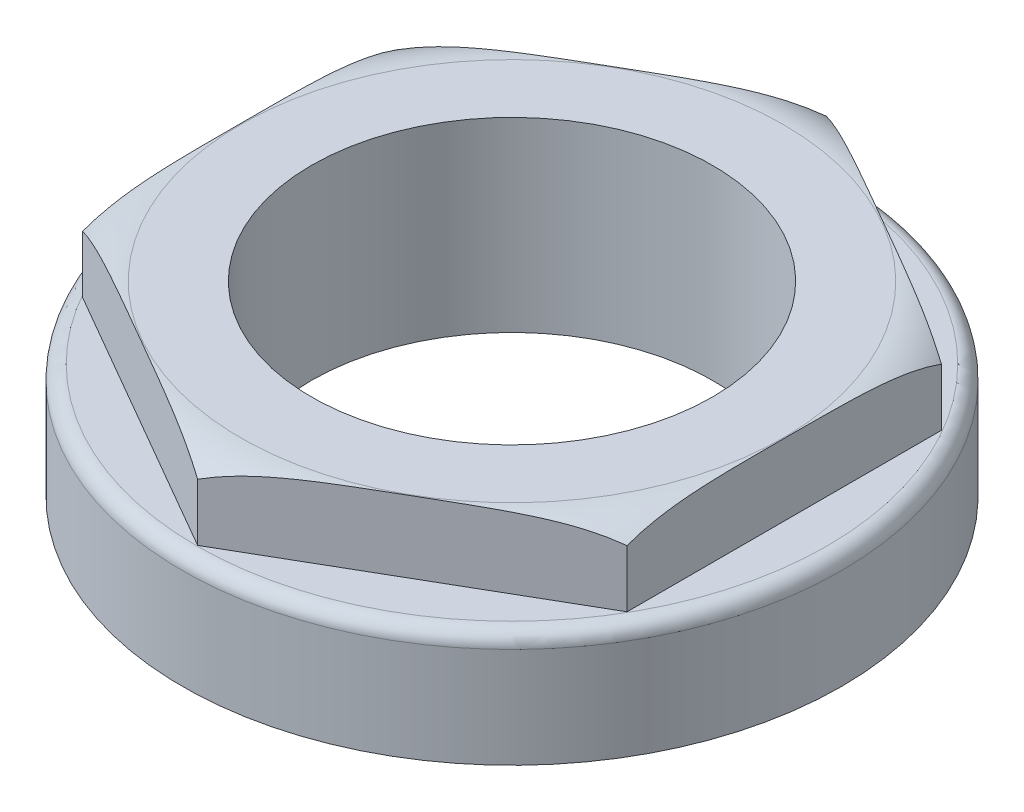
ISO-10303-21;
HEADER;
FILE_DESCRIPTION(('STEP AP214'),'2;1');
FILE_NAME('part.step','',(''),(''),'','','');
FILE_SCHEMA(('AUTOMOTIVE_DESIGN { 1 0 10303 214 1 1 1 1 }'));
ENDSEC;
DATA;
#1=APPLICATION_CONTEXT('core data for automotive mechanical design processes');
#2=APPLICATION_PROTOCOL_DEFINITION('international standard','automotive_design',2000,#1);
#3=PRODUCT_CONTEXT('',#1,'mechanical');
#4=PRODUCT('Part','Part','',(#3));
#5=PRODUCT_RELATED_PRODUCT_CATEGORY('part','',(#4));
#6=PRODUCT_DEFINITION_FORMATION('','',#4);
#7=PRODUCT_DEFINITION_CONTEXT('part definition',#1,'design');
#8=PRODUCT_DEFINITION('design','',#6,#7);
#9=PRODUCT_DEFINITION_SHAPE('','',#8);
#10=(LENGTH_UNIT() NAMED_UNIT(*) SI_UNIT(.MILLI.,.METRE.));
#11=(NAMED_UNIT(*) PLANE_ANGLE_UNIT() SI_UNIT($,.RADIAN.));
#12=(NAMED_UNIT(*) SI_UNIT($,.STERADIAN.) SOLID_ANGLE_UNIT());
#13=UNCERTAINTY_MEASURE_WITH_UNIT(LENGTH_MEASURE(1.E-05),#10,'distance_accuracy_value','');
#14=(GEOMETRIC_REPRESENTATION_CONTEXT(3) GLOBAL_UNCERTAINTY_ASSIGNED_CONTEXT((#13)) GLOBAL_UNIT_ASSIGNED_CONTEXT((#10,
#11,#12)) REPRESENTATION_CONTEXT('',''));
#15=CARTESIAN_POINT('',(0.,0.,0.));
#16=DIRECTION('',(0.,0.,1.));
#17=DIRECTION('',(1.,0.,0.));
#18=AXIS2_PLACEMENT_3D('',#15,#16,#17);
#19=CARTESIAN_POINT('',(19.,-58.045958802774,-10.9696551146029));
#20=DIRECTION('',(0.5,0.,-0.866025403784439));
#21=DIRECTION('',(-0.866025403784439,0.,-0.5));
#22=AXIS2_PLACEMENT_3D('',#19,#20,#21);
#23=PLANE('',#22);
#24=DIRECTION('',(0.,1.,0.));
#25=VECTOR('',#24,1.);
#26=CARTESIAN_POINT('',(0.,-58.045958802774,-21.9393102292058));
#27=LINE('',#26,#25);
#28=CARTESIAN_POINT('',(0.,2.,-21.9393102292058));
#29=VERTEX_POINT('',#28);
#30=CARTESIAN_POINT('',(0.,6.,-21.9393102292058));
#31=VERTEX_POINT('',#30);
#32=EDGE_CURVE('E99',#29,#31,#27,.T.);
#33=ORIENTED_EDGE('',*,*,#32,.T.);
#34=CARTESIAN_POINT('',(-0.000200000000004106,5.99991339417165,-21.9394256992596));
#35=CARTESIAN_POINT('',(0.148237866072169,6.06416734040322,-21.8537250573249));
#36=CARTESIAN_POINT('',(0.298156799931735,6.12368368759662,-21.7671693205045));
#37=CARTESIAN_POINT('',(0.600251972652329,6.23413918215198,-21.5927545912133));
#38=CARTESIAN_POINT('',(0.752426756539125,6.28508361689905,-21.5048964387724));
#39=CARTESIAN_POINT('',(1.05804415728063,6.37922577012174,-21.3284481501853));
#40=CARTESIAN_POINT('',(1.2114814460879,6.42244679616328,-21.2398610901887));
#41=CARTESIAN_POINT('',(1.51967527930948,6.50216553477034,-21.0619252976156));
#42=CARTESIAN_POINT('',(1.6744320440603,6.53866210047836,-20.9725764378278));
#43=CARTESIAN_POINT('',(2.14074382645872,6.63936169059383,-20.7033512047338));
#44=CARTESIAN_POINT('',(2.45376390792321,6.69460380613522,-20.5226289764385));
#45=CARTESIAN_POINT('',(2.92482405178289,6.76365566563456,-20.2506622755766));
#46=CARTESIAN_POINT('',(3.0821683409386,6.78437711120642,-20.1598195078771));
#47=CARTESIAN_POINT('',(3.39721719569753,6.82179787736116,-19.9779259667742));
#48=CARTESIAN_POINT('',(3.55492175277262,6.83849729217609,-19.8868751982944));
#49=CARTESIAN_POINT('',(3.95811915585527,6.87674254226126,-19.6540890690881));
#50=CARTESIAN_POINT('',(4.20378424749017,6.89583849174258,-19.5122542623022));
#51=CARTESIAN_POINT('',(4.69543372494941,6.92756527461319,-19.2284003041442));
#52=CARTESIAN_POINT('',(4.9414181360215,6.94019556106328,-19.0863811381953));
#53=CARTESIAN_POINT('',(5.43361965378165,6.96064049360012,-18.8022084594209));
#54=CARTESIAN_POINT('',(5.67983681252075,6.96845339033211,-18.6600549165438));
#55=CARTESIAN_POINT('',(6.17232306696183,6.98067503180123,-18.37571784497));
#56=CARTESIAN_POINT('',(6.41859216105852,6.98508386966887,-18.2335343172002));
#57=CARTESIAN_POINT('',(6.91141536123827,6.99168275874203,-17.9490027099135));
#58=CARTESIAN_POINT('',(7.15796948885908,6.99387041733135,-17.8066546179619));
#59=CARTESIAN_POINT('',(7.65108384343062,6.99695413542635,-17.5219549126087));
#60=CARTESIAN_POINT('',(7.89764407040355,6.99785018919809,-17.3796032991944));
#61=CARTESIAN_POINT('',(8.39070366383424,6.9990202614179,-17.0949352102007));
#62=CARTESIAN_POINT('',(8.63720303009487,6.99929443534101,-16.9526187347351));
#63=CARTESIAN_POINT('',(9.13020105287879,6.99960994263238,-16.6679861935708));
#64=CARTESIAN_POINT('',(9.37669970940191,6.9996512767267,-16.5256701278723));
#65=CARTESIAN_POINT('',(9.86954144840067,6.99959907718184,-16.2411278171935));
#66=CARTESIAN_POINT('',(10.1158845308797,6.99950562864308,-16.0989015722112));
#67=CARTESIAN_POINT('',(10.6085714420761,6.99898888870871,-15.8144486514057));
#68=CARTESIAN_POINT('',(10.854915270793,6.99856559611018,-15.6722219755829));
#69=CARTESIAN_POINT('',(11.3476691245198,6.99690649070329,-15.3877304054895));
#70=CARTESIAN_POINT('',(11.594079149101,6.9956704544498,-15.2454655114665));
#71=CARTESIAN_POINT('',(12.0868896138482,6.99162741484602,-14.9609412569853));
#72=CARTESIAN_POINT('',(12.3332900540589,6.98882042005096,-14.8186818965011));
#73=CARTESIAN_POINT('',(12.8257539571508,6.98062254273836,-14.5343577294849));
#74=CARTESIAN_POINT('',(13.0718174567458,6.97523488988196,-14.392292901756));
#75=CARTESIAN_POINT('',(13.5638723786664,6.96061892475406,-14.108204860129));
#76=CARTESIAN_POINT('',(13.8098637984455,6.95139049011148,-13.9661816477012));
#77=CARTESIAN_POINT('',(14.3015568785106,6.92760586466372,-13.682302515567));
#78=CARTESIAN_POINT('',(14.5472586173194,6.91305192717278,-13.5404465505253));
#79=CARTESIAN_POINT('',(15.0382654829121,6.87689657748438,-13.2569636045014));
#80=CARTESIAN_POINT('',(15.2835706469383,6.85529587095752,-13.1153366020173));
#81=CARTESIAN_POINT('',(15.6760887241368,6.81345804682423,-12.8887161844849));
#82=CARTESIAN_POINT('',(15.8235296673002,6.7960925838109,-12.80359111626));
#83=CARTESIAN_POINT('',(16.118043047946,6.75760805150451,-12.6335537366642));
#84=CARTESIAN_POINT('',(16.2651154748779,6.73648887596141,-12.5486414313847));
#85=CARTESIAN_POINT('',(16.705416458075,6.66677447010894,-12.2944335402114));
#86=CARTESIAN_POINT('',(16.9979433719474,6.61180096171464,-12.125543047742));
#87=CARTESIAN_POINT('',(17.4338057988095,6.51319175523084,-11.8738977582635));
#88=CARTESIAN_POINT('',(17.5785294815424,6.47765359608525,-11.7903415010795));
#89=CARTESIAN_POINT('',(17.8667542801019,6.40053963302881,-11.6239348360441));
#90=CARTESIAN_POINT('',(18.0102555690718,6.35896469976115,-11.5410843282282));
#91=CARTESIAN_POINT('',(18.296062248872,6.26896644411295,-11.3760737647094));
#92=CARTESIAN_POINT('',(18.438363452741,6.22052523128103,-11.2939161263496));
#93=CARTESIAN_POINT('',(18.7209453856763,6.11608171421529,-11.1307673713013));
#94=CARTESIAN_POINT('',(18.861225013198,6.06007544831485,-11.0497768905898));
#95=CARTESIAN_POINT('',(19.0002,5.99991339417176,-10.9695396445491));
#96=B_SPLINE_CURVE_WITH_KNOTS('',3,(#34,#35,#36,#37,#38,#39,#40,#41,#42,#43,#44,#45,#46,#47,#48,
#49,#50,#51,#52,#53,#54,#55,#56,#57,#58,#59,#60,#61,#62,#63,#64,#65,#66,#67,#68,#69,#70,#71,#72,
#73,#74,#75,#76,#77,#78,#79,#80,#81,#82,#83,#84,#85,#86,#87,#88,#89,#90,#91,#92,#93,#94,#95),
.UNSPECIFIED.,.F.,.F.,(4,2,2,2,2,2,2,2,2,2,2,2,2,2,2,2,2,2,2,2,2,2,2,2,2,2,2,2,2,2,4),(0.,
0.548988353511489,1.09763682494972,1.6446005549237,2.19165748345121,3.28782837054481,
3.83639446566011,4.3849477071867,5.23778011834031,6.09068465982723,6.94389873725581,
7.79708947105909,8.65119827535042,9.50531087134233,10.3592099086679,11.2131062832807,
12.0664637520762,12.9198243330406,13.7734196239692,14.6270102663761,15.479535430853,
16.3320877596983,17.1842797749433,18.0363864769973,18.5497465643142,19.063121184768,
20.089124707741,20.6015844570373,21.1139703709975,21.6277167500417,22.1417332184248),.UNSPECIFIED.);
#97=CARTESIAN_POINT('',(19.,5.99999999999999,-10.9696551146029));
#98=VERTEX_POINT('',#97);
#99=EDGE_CURVE('E47',#31,#98,#96,.T.);
#100=ORIENTED_EDGE('',*,*,#99,.T.);
#101=DIRECTION('',(0.,1.,0.));
#102=VECTOR('',#101,1.);
#103=CARTESIAN_POINT('',(19.,-58.045958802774,-10.9696551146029));
#104=LINE('',#103,#102);
#105=CARTESIAN_POINT('',(19.,2.,-10.9696551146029));
#106=VERTEX_POINT('',#105);
#107=EDGE_CURVE('E97',#106,#98,#104,.T.);
#108=ORIENTED_EDGE('',*,*,#107,.F.);
#109=DIRECTION('',(-0.866025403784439,0.,-0.5));
#110=VECTOR('',#109,1.);
#111=CARTESIAN_POINT('',(26.75,2.,-6.4951905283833));
#112=LINE('',#111,#110);
#113=EDGE_CURVE('E130',#106,#29,#112,.T.);
#114=ORIENTED_EDGE('',*,*,#113,.T.);
#115=EDGE_LOOP('',(#33,#100,#108,#114));
#116=FACE_BOUND('',#115,.T.);
#117=ADVANCED_FACE('F32',(#116),#23,.T.);
#118=CARTESIAN_POINT('',(19.,-58.045958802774,10.9696551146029));
#119=DIRECTION('',(1.,0.,0.));
#120=DIRECTION('',(0.,0.,-1.));
#121=AXIS2_PLACEMENT_3D('',#118,#119,#120);
#122=PLANE('',#121);
#123=ORIENTED_EDGE('',*,*,#107,.T.);
#124=CARTESIAN_POINT('',(19.,6.99963166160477,0.));
#125=CARTESIAN_POINT('',(19.,6.99963666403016,0.421055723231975));
#126=CARTESIAN_POINT('',(19.,6.99952182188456,0.842111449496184));
#127=CARTESIAN_POINT('',(19.,6.99837124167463,1.68423710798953));
#128=CARTESIAN_POINT('',(19.,6.99733547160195,2.10530704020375));
#129=CARTESIAN_POINT('',(19.,6.99226415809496,2.94840806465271));
#130=CARTESIAN_POINT('',(19.,6.98822169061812,3.37043913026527));
#131=CARTESIAN_POINT('',(19.,6.97377809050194,4.2143811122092));
#132=CARTESIAN_POINT('',(19.,6.96337740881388,4.63629203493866));
#133=CARTESIAN_POINT('',(19.,6.93188628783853,5.47464152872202));
#134=CARTESIAN_POINT('',(19.,6.91092691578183,5.89108445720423));
#135=CARTESIAN_POINT('',(19.,6.8529359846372,6.72306356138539));
#136=CARTESIAN_POINT('',(19.,6.81589854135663,7.13859934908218));
#137=CARTESIAN_POINT('',(19.,6.71935255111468,7.96556310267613));
#138=CARTESIAN_POINT('',(19.,6.65993465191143,8.37700085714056));
#139=CARTESIAN_POINT('',(19.,6.5480881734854,8.98984084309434));
#140=CARTESIAN_POINT('',(19.,6.50703933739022,9.19332481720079));
#141=CARTESIAN_POINT('',(19.,6.41622666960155,9.59832433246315));
#142=CARTESIAN_POINT('',(19.,6.36646456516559,9.7998402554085));
#143=CARTESIAN_POINT('',(19.,6.26573350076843,10.1681930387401));
#144=CARTESIAN_POINT('',(19.,6.21622651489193,10.335428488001));
#145=CARTESIAN_POINT('',(19.,6.10936568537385,10.6674539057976));
#146=CARTESIAN_POINT('',(19.,6.05200917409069,10.8322430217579));
#147=CARTESIAN_POINT('',(19.,5.92843184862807,11.1590020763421));
#148=CARTESIAN_POINT('',(19.,5.86218725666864,11.3209630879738));
#149=CARTESIAN_POINT('',(19.,5.72004563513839,11.6405924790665));
#150=CARTESIAN_POINT('',(19.,5.6441495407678,11.7982612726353));
#151=CARTESIAN_POINT('',(19.,5.48067371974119,12.1100598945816));
#152=CARTESIAN_POINT('',(19.,5.3929579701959,12.2641194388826));
#153=CARTESIAN_POINT('',(19.,5.20568772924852,12.564814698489));
#154=CARTESIAN_POINT('',(19.,5.1061303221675,12.7114485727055));
#155=CARTESIAN_POINT('',(19.,4.78871785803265,13.1362340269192));
#156=CARTESIAN_POINT('',(19.,4.55133442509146,13.4008519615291));
#157=CARTESIAN_POINT('',(19.,4.13397392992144,13.7690332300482));
#158=CARTESIAN_POINT('',(19.,3.97218356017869,13.8933771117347));
#159=CARTESIAN_POINT('',(19.,3.63091651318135,14.1154753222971));
#160=CARTESIAN_POINT('',(19.,3.45144983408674,14.2132445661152));
#161=CARTESIAN_POINT('',(19.,3.17064575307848,14.3354068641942));
#162=CARTESIAN_POINT('',(19.,3.07457095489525,14.372173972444));
#163=CARTESIAN_POINT('',(19.,2.8794113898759,14.4365273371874));
#164=CARTESIAN_POINT('',(19.,2.78032823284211,14.4641184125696));
#165=CARTESIAN_POINT('',(19.,2.57998473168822,14.5094878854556));
#166=CARTESIAN_POINT('',(19.,2.47872541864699,14.5272708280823));
#167=CARTESIAN_POINT('',(19.,2.2749384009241,14.5526136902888));
#168=CARTESIAN_POINT('',(19.,2.17241087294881,14.5601750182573));
#169=CARTESIAN_POINT('',(19.,1.9801465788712,14.5645854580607));
#170=CARTESIAN_POINT('',(19.,1.89043684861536,14.5626716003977));
#171=CARTESIAN_POINT('',(19.,1.7115256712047,14.5509592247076));
#172=CARTESIAN_POINT('',(19.,1.62232439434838,14.5411582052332));
#173=CARTESIAN_POINT('',(19.,1.3565860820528,14.5001494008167));
#174=CARTESIAN_POINT('',(19.,1.18171608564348,14.4573398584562));
#175=CARTESIAN_POINT('',(19.,0.846120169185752,14.345337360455));
#176=CARTESIAN_POINT('',(19.,0.685140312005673,14.2768850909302));
#177=CARTESIAN_POINT('',(19.,0.374845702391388,14.117439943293));
#178=CARTESIAN_POINT('',(19.,0.225534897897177,14.0264394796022));
#179=CARTESIAN_POINT('',(19.,-0.130769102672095,13.7761937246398));
#180=CARTESIAN_POINT('',(19.,-0.329699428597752,13.6054720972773));
#181=CARTESIAN_POINT('',(19.,-0.697871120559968,13.2344244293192));
#182=CARTESIAN_POINT('',(19.,-0.867034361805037,13.0340229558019));
#183=CARTESIAN_POINT('',(19.,-1.14215878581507,12.6608666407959));
#184=CARTESIAN_POINT('',(19.,-1.25374811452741,12.4921713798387));
#185=CARTESIAN_POINT('',(19.,-1.46177905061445,12.1456043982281));
#186=CARTESIAN_POINT('',(19.,-1.55821163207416,11.9677272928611));
#187=CARTESIAN_POINT('',(19.,-1.73739481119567,11.6051384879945));
#188=CARTESIAN_POINT('',(19.,-1.82013666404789,11.4204225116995));
#189=CARTESIAN_POINT('',(19.,-1.97332042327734,11.0460497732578));
#190=CARTESIAN_POINT('',(19.,-2.0437648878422,10.8563940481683));
#191=CARTESIAN_POINT('',(19.,-2.18889619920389,10.4288209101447));
#192=CARTESIAN_POINT('',(19.,-2.26075243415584,10.189947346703));
#193=CARTESIAN_POINT('',(19.,-2.39028818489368,9.70834320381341));
#194=CARTESIAN_POINT('',(19.,-2.44796176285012,9.46561105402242));
#195=CARTESIAN_POINT('',(19.,-2.55129296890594,8.97721976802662));
#196=CARTESIAN_POINT('',(19.,-2.59693075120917,8.73155648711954));
#197=CARTESIAN_POINT('',(19.,-2.67795309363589,8.23860427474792));
#198=CARTESIAN_POINT('',(19.,-2.71333895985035,7.99131555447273));
#199=CARTESIAN_POINT('',(19.,-2.7757514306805,7.49412378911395));
#200=CARTESIAN_POINT('',(19.,-2.80272404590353,7.24421408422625));
#201=CARTESIAN_POINT('',(19.,-2.84954675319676,6.74373528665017));
#202=CARTESIAN_POINT('',(19.,-2.86939663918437,6.49316617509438));
#203=CARTESIAN_POINT('',(19.,-2.90333700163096,5.99186490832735));
#204=CARTESIAN_POINT('',(19.,-2.91743242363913,5.74113307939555));
#205=CARTESIAN_POINT('',(19.,-2.94110636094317,5.23946770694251));
#206=CARTESIAN_POINT('',(19.,-2.95068495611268,4.98853416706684));
#207=CARTESIAN_POINT('',(19.,-2.9728611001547,4.28150872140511));
#208=CARTESIAN_POINT('',(19.,-2.98153145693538,3.82529894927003));
#209=CARTESIAN_POINT('',(19.,-2.99293535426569,2.91280305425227));
#210=CARTESIAN_POINT('',(19.,-2.99566849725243,2.45651692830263));
#211=CARTESIAN_POINT('',(19.,-2.99884044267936,1.54368809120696));
#212=CARTESIAN_POINT('',(19.,-2.99927798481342,1.08714537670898));
#213=CARTESIAN_POINT('',(19.,-2.99970944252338,0.174082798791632));
#214=CARTESIAN_POINT('',(19.,-2.99970337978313,-0.282437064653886));
#215=CARTESIAN_POINT('',(19.,-2.99916945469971,-1.19628692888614));
#216=CARTESIAN_POINT('',(19.,-2.99864066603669,-1.65361692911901));
#217=CARTESIAN_POINT('',(19.,-2.9950491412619,-2.56831430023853));
#218=CARTESIAN_POINT('',(19.,-2.99198618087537,-3.02568167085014));
#219=CARTESIAN_POINT('',(19.,-2.97950719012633,-3.93998719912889));
#220=CARTESIAN_POINT('',(19.,-2.97009612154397,-4.39692541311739));
#221=CARTESIAN_POINT('',(19.,-2.93948948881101,-5.31040151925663));
#222=CARTESIAN_POINT('',(19.,-2.91829605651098,-5.76693946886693));
#223=CARTESIAN_POINT('',(19.,-2.87208178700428,-6.45540507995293));
#224=CARTESIAN_POINT('',(19.,-2.85402311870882,-6.68779334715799));
#225=CARTESIAN_POINT('',(19.,-2.81189819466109,-7.15201818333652));
#226=CARTESIAN_POINT('',(19.,-2.78783238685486,-7.38385479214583));
#227=CARTESIAN_POINT('',(19.,-2.7324537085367,-7.84697050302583));
#228=CARTESIAN_POINT('',(19.,-2.70113174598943,-8.07824853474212));
#229=CARTESIAN_POINT('',(19.,-2.62991033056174,-8.53948870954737));
#230=CARTESIAN_POINT('',(19.,-2.59001125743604,-8.76945091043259));
#231=CARTESIAN_POINT('',(19.,-2.50061657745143,-9.22498920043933));
#232=CARTESIAN_POINT('',(19.,-2.45122743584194,-9.45058593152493));
#233=CARTESIAN_POINT('',(19.,-2.34096562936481,-9.89903434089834));
#234=CARTESIAN_POINT('',(19.,-2.28009087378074,-10.1218855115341));
#235=CARTESIAN_POINT('',(19.,-2.14523374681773,-10.5630562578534));
#236=CARTESIAN_POINT('',(19.,-2.07128232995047,-10.7813852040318));
#237=CARTESIAN_POINT('',(19.,-1.9082510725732,-11.2122591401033));
#238=CARTESIAN_POINT('',(19.,-1.81918047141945,-11.4248075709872));
#239=CARTESIAN_POINT('',(19.,-1.65266590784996,-11.7801893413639));
#240=CARTESIAN_POINT('',(19.,-1.57956748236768,-11.9250588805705));
#241=CARTESIAN_POINT('',(19.,-1.42401233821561,-12.2097440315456));
#242=CARTESIAN_POINT('',(19.,-1.34155441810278,-12.3495589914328));
#243=CARTESIAN_POINT('',(19.,-1.16652741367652,-12.622739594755));
#244=CARTESIAN_POINT('',(19.,-1.07395942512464,-12.756105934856));
#245=CARTESIAN_POINT('',(19.,-0.878060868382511,-13.0146220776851));
#246=CARTESIAN_POINT('',(19.,-0.774734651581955,-13.1397751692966));
#247=CARTESIAN_POINT('',(19.,-0.512969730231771,-13.4280065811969));
#248=CARTESIAN_POINT('',(19.,-0.349031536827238,-13.5862004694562));
#249=CARTESIAN_POINT('',(19.,0.00152040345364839,-13.8750697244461));
#250=CARTESIAN_POINT('',(19.,0.188099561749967,-14.0057862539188));
#251=CARTESIAN_POINT('',(19.,0.546726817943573,-14.2109912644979));
#252=CARTESIAN_POINT('',(19.,0.715387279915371,-14.2913581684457));
#253=CARTESIAN_POINT('',(19.,1.06378627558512,-14.4229590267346));
#254=CARTESIAN_POINT('',(19.,1.2435180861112,-14.4742104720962));
#255=CARTESIAN_POINT('',(19.,1.61025243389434,-14.5439795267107));
#256=CARTESIAN_POINT('',(19.,1.79728663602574,-14.5623333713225));
#257=CARTESIAN_POINT('',(19.,2.17152560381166,-14.5642462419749));
#258=CARTESIAN_POINT('',(19.,2.35873034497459,-14.5478096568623));
#259=CARTESIAN_POINT('',(19.,2.71222491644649,-14.4842307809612));
#260=CARTESIAN_POINT('',(19.,2.87898838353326,-14.4396554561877));
#261=CARTESIAN_POINT('',(19.,3.20350595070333,-14.325189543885));
#262=CARTESIAN_POINT('',(19.,3.36125725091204,-14.2552911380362));
#263=CARTESIAN_POINT('',(19.,3.71696616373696,-14.0663803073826));
#264=CARTESIAN_POINT('',(19.,3.91034501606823,-13.9387490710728));
#265=CARTESIAN_POINT('',(19.,4.2738120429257,-13.6538609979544));
#266=CARTESIAN_POINT('',(19.,4.44385476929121,-13.4965477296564));
#267=CARTESIAN_POINT('',(19.,4.83241111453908,-13.0841416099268));
#268=CARTESIAN_POINT('',(19.,5.03810907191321,-12.8169854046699));
#269=CARTESIAN_POINT('',(19.,5.31365821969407,-12.3954464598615));
#270=CARTESIAN_POINT('',(19.,5.40010092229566,-12.251261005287));
#271=CARTESIAN_POINT('',(19.,5.56290738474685,-11.9572921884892));
#272=CARTESIAN_POINT('',(19.,5.6392728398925,-11.8075097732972));
#273=CARTESIAN_POINT('',(19.,5.83695210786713,-11.3888618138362));
#274=CARTESIAN_POINT('',(19.,5.94867092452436,-11.1154694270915));
#275=CARTESIAN_POINT('',(19.,6.1481458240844,-10.5600338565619));
#276=CARTESIAN_POINT('',(19.,6.23588122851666,-10.2779834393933));
#277=CARTESIAN_POINT('',(19.,6.39139261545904,-9.7080406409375));
#278=CARTESIAN_POINT('',(19.,6.45913697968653,-9.42013976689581));
#279=CARTESIAN_POINT('',(19.,6.57795176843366,-8.84112079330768));
#280=CARTESIAN_POINT('',(19.,6.62902929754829,-8.55000411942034));
#281=CARTESIAN_POINT('',(19.,6.72480744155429,-7.91833258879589));
#282=CARTESIAN_POINT('',(19.,6.76712709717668,-7.57742335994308));
#283=CARTESIAN_POINT('',(19.,6.83760816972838,-6.8941141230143));
#284=CARTESIAN_POINT('',(19.,6.86576573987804,-6.55171373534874));
#285=CARTESIAN_POINT('',(19.,6.91150416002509,-5.86580428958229));
#286=CARTESIAN_POINT('',(19.,6.92907159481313,-5.52229437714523));
#287=CARTESIAN_POINT('',(19.,6.95663298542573,-4.83502320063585));
#288=CARTESIAN_POINT('',(19.,6.96662762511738,-4.49126196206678));
#289=CARTESIAN_POINT('',(19.,6.98164964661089,-3.80170262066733));
#290=CARTESIAN_POINT('',(19.,6.98664870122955,-3.45590396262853));
#291=CARTESIAN_POINT('',(19.,6.99366910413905,-2.76427582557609));
#292=CARTESIAN_POINT('',(19.,6.99569040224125,-2.41844634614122));
#293=CARTESIAN_POINT('',(19.,6.9982927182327,-1.7271780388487));
#294=CARTESIAN_POINT('',(19.,6.99887537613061,-1.38173921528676));
#295=CARTESIAN_POINT('',(19.,6.99954279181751,-0.690866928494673));
#296=CARTESIAN_POINT('',(19.,6.99962755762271,-0.345433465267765));
#297=CARTESIAN_POINT('',(19.,6.99963166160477,0.));
#298=B_SPLINE_CURVE_WITH_KNOTS('',3,(#124,#125,#126,#127,#128,#129,#130,#131,#132,#133,#134,
#135,#136,#137,#138,#139,#140,#141,#142,#143,#144,#145,#146,#147,#148,#149,#150,#151,#152,#153,
#154,#155,#156,#157,#158,#159,#160,#161,#162,#163,#164,#165,#166,#167,#168,#169,#170,#171,#172,
#173,#174,#175,#176,#177,#178,#179,#180,#181,#182,#183,#184,#185,#186,#187,#188,#189,#190,#191,
#192,#193,#194,#195,#196,#197,#198,#199,#200,#201,#202,#203,#204,#205,#206,#207,#208,#209,#210,
#211,#212,#213,#214,#215,#216,#217,#218,#219,#220,#221,#222,#223,#224,#225,#226,#227,#228,#229,
#230,#231,#232,#233,#234,#235,#236,#237,#238,#239,#240,#241,#242,#243,#244,#245,#246,#247,#248,
#249,#250,#251,#252,#253,#254,#255,#256,#257,#258,#259,#260,#261,#262,#263,#264,#265,#266,#267,
#268,#269,#270,#271,#272,#273,#274,#275,#276,#277,#278,#279,#280,#281,#282,#283,#284,#285,#286,
#287,#288,#289,#290,#291,#292,#293,#294,#295,#296,#297),.UNSPECIFIED.,.T.,.F.,(4,2,2,2,2,2,2,2,
2,2,2,2,2,2,2,2,2,2,2,2,2,2,2,2,2,2,2,2,2,2,2,2,2,2,2,2,2,2,2,2,2,2,2,2,2,2,2,2,2,2,2,2,2,2,2,2,
2,2,2,2,2,2,2,2,2,2,2,2,2,2,2,2,2,2,2,2,2,2,2,2,2,2,2,2,2,2,4),(0.,1.26316714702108,
2.52637819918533,3.7925073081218,5.05854662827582,6.30924391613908,7.56039931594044,
8.80654071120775,9.42913794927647,10.0516119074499,10.5746730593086,11.0979124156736,
11.6225805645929,12.1471979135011,12.6784715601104,13.209876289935,14.2674396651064,
14.8776920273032,15.4876011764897,15.7958335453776,16.1039037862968,16.4118311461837,
16.719716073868,16.9885508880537,17.2574709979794,17.7947238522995,18.3175247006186,
18.8405016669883,19.6225306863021,20.4065825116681,21.012544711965,21.6188664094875,
22.2255739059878,22.832155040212,23.5799576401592,24.328072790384,25.0774139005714,
25.8266595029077,26.5806186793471,27.334599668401,28.0879312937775,28.8412495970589,
30.2100331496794,31.5789083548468,32.9485350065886,34.3180947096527,35.690085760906,
37.062198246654,38.4332395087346,39.804032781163,40.5032378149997,41.2023907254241,
41.9024244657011,42.6024272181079,43.2949925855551,43.9876841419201,44.6787574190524,
45.3694098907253,45.8559149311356,46.3424824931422,46.8289973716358,47.3153162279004,
47.9963971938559,48.6764504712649,49.2346375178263,49.7924888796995,50.3531095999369,
50.9136596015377,51.429276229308,51.9450521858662,52.6362907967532,53.3288570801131,
54.3343586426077,54.8384478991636,55.3424522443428,56.2269855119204,57.1122790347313,
57.9989653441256,58.8852731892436,59.9154495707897,60.9459056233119,61.9776642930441,
63.0093297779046,64.0468126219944,65.0843129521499,66.120630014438,67.1569303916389),.UNSPECIFIED.);
#299=CARTESIAN_POINT('',(19.,6.,10.9696551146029));
#300=VERTEX_POINT('',#299);
#301=EDGE_CURVE('E85',#98,#300,#298,.T.);
#302=ORIENTED_EDGE('',*,*,#301,.T.);
#303=DIRECTION('',(0.,1.,0.));
#304=VECTOR('',#303,1.);
#305=CARTESIAN_POINT('',(19.,-58.045958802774,10.9696551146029));
#306=LINE('',#305,#304);
#307=CARTESIAN_POINT('',(19.,2.,10.9696551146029));
#308=VERTEX_POINT('',#307);
#309=EDGE_CURVE('E106',#308,#300,#306,.T.);
#310=ORIENTED_EDGE('',*,*,#309,.F.);
#311=DIRECTION('',(0.,0.,-1.));
#312=VECTOR('',#311,1.);
#313=CARTESIAN_POINT('',(19.,2.,0.));
#314=LINE('',#313,#312);
#315=EDGE_CURVE('E104',#308,#106,#314,.T.);
#316=ORIENTED_EDGE('',*,*,#315,.T.);
#317=EDGE_LOOP('',(#123,#302,#310,#316));
#318=FACE_BOUND('',#317,.T.);
#319=ADVANCED_FACE('F102',(#318),#122,.T.);
#320=CARTESIAN_POINT('',(0.,-58.045958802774,21.9393102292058));
#321=DIRECTION('',(0.5,0.,0.866025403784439));
#322=DIRECTION('',(0.866025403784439,0.,-0.5));
#323=AXIS2_PLACEMENT_3D('',#320,#321,#322);
#324=PLANE('',#323);
#325=ORIENTED_EDGE('',*,*,#309,.T.);
#326=CARTESIAN_POINT('',(19.0002,5.99991339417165,10.9695396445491));
#327=CARTESIAN_POINT('',(18.8517621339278,6.06416734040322,11.0552402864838));
#328=CARTESIAN_POINT('',(18.7018432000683,6.12368368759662,11.1417960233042));
#329=CARTESIAN_POINT('',(18.3997480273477,6.23413918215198,11.3162107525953));
#330=CARTESIAN_POINT('',(18.2475732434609,6.28508361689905,11.4040689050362));
#331=CARTESIAN_POINT('',(17.9419558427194,6.37922577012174,11.5805171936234));
#332=CARTESIAN_POINT('',(17.7885185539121,6.42244679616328,11.66910425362));
#333=CARTESIAN_POINT('',(17.4803247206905,6.50216553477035,11.847040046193));
#334=CARTESIAN_POINT('',(17.3255679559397,6.53866210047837,11.9363889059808));
#335=CARTESIAN_POINT('',(16.8592561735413,6.63936169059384,12.2056141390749));
#336=CARTESIAN_POINT('',(16.5462360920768,6.69460380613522,12.3863363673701));
#337=CARTESIAN_POINT('',(16.0751759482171,6.76365566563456,12.658303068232));
#338=CARTESIAN_POINT('',(15.9178316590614,6.78437711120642,12.7491458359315));
#339=CARTESIAN_POINT('',(15.6027828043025,6.82179787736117,12.9310393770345));
#340=CARTESIAN_POINT('',(15.4450782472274,6.8384972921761,13.0220901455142));
#341=CARTESIAN_POINT('',(15.0418808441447,6.87674254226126,13.2548762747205));
#342=CARTESIAN_POINT('',(14.7962157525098,6.89583849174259,13.3967110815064));
#343=CARTESIAN_POINT('',(14.3045662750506,6.9275652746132,13.6805650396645));
#344=CARTESIAN_POINT('',(14.0585818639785,6.94019556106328,13.8225842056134));
#345=CARTESIAN_POINT('',(13.5663803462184,6.96064049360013,14.1067568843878));
#346=CARTESIAN_POINT('',(13.3201631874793,6.96845339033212,14.2489104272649));
#347=CARTESIAN_POINT('',(12.8276769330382,6.98067503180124,14.5332474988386));
#348=CARTESIAN_POINT('',(12.5814078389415,6.98508386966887,14.6754310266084));
#349=CARTESIAN_POINT('',(12.0885846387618,6.99168275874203,14.9599626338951));
#350=CARTESIAN_POINT('',(11.8420305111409,6.99387041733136,15.1023107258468));
#351=CARTESIAN_POINT('',(11.3489161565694,6.99695413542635,15.3870104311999));
#352=CARTESIAN_POINT('',(11.1023559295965,6.99785018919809,15.5293620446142));
#353=CARTESIAN_POINT('',(10.6092963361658,6.99902026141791,15.814030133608));
#354=CARTESIAN_POINT('',(10.3627969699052,6.99929443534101,15.9563466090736));
#355=CARTESIAN_POINT('',(9.86979894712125,6.99960994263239,16.2409791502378));
#356=CARTESIAN_POINT('',(9.62330029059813,6.99965127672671,16.3832952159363));
#357=CARTESIAN_POINT('',(9.13045855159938,6.99959907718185,16.6678375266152));
#358=CARTESIAN_POINT('',(8.88411546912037,6.99950562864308,16.8100637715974));
#359=CARTESIAN_POINT('',(8.39142855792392,6.99898888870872,17.0945166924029));
#360=CARTESIAN_POINT('',(8.14508472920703,6.99856559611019,17.2367433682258));
#361=CARTESIAN_POINT('',(7.65233087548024,6.9969064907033,17.5212349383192));
#362=CARTESIAN_POINT('',(7.40592085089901,6.9956704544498,17.6634998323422));
#363=CARTESIAN_POINT('',(6.91311038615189,6.99162741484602,17.9480240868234));
#364=CARTESIAN_POINT('',(6.66670994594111,6.98882042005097,18.0902834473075));
#365=CARTESIAN_POINT('',(6.17424604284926,6.98062254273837,18.3746076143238));
#366=CARTESIAN_POINT('',(5.92818254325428,6.97523488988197,18.5166724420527));
#367=CARTESIAN_POINT('',(5.43612762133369,6.96061892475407,18.8007604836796));
#368=CARTESIAN_POINT('',(5.19013620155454,6.95139049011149,18.9427836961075));
#369=CARTESIAN_POINT('',(4.69844312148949,6.92760586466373,19.2266628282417));
#370=CARTESIAN_POINT('',(4.45274138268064,6.91305192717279,19.3685187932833));
#371=CARTESIAN_POINT('',(3.961734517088,6.87689657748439,19.6520017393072));
#372=CARTESIAN_POINT('',(3.71642935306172,6.85529587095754,19.7936287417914));
#373=CARTESIAN_POINT('',(3.32391127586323,6.81345804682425,20.0202491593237));
#374=CARTESIAN_POINT('',(3.17647033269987,6.79609258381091,20.1053742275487));
#375=CARTESIAN_POINT('',(2.88195695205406,6.75760805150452,20.2754116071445));
#376=CARTESIAN_POINT('',(2.73488452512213,6.73648887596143,20.360323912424));
#377=CARTESIAN_POINT('',(2.29458354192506,6.66677447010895,20.6145318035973));
#378=CARTESIAN_POINT('',(2.00205662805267,6.61180096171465,20.7834222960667));
#379=CARTESIAN_POINT('',(1.56619420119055,6.51319175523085,21.0350675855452));
#380=CARTESIAN_POINT('',(1.42147051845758,6.47765359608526,21.1186238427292));
#381=CARTESIAN_POINT('',(1.13324571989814,6.40053963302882,21.2850305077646));
#382=CARTESIAN_POINT('',(0.989744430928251,6.35896469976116,21.3678810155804));
#383=CARTESIAN_POINT('',(0.703937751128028,6.26896644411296,21.5328915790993));
#384=CARTESIAN_POINT('',(0.561636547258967,6.22052523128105,21.6150492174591));
#385=CARTESIAN_POINT('',(0.279054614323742,6.1160817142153,21.7781979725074));
#386=CARTESIAN_POINT('',(0.138774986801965,6.06007544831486,21.8591884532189));
#387=CARTESIAN_POINT('',(-0.000200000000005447,5.99991339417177,21.9394256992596));
#388=B_SPLINE_CURVE_WITH_KNOTS('',3,(#326,#327,#328,#329,#330,#331,#332,#333,#334,#335,#336,
#337,#338,#339,#340,#341,#342,#343,#344,#345,#346,#347,#348,#349,#350,#351,#352,#353,#354,#355,
#356,#357,#358,#359,#360,#361,#362,#363,#364,#365,#366,#367,#368,#369,#370,#371,#372,#373,#374,
#375,#376,#377,#378,#379,#380,#381,#382,#383,#384,#385,#386,#387),.UNSPECIFIED.,.F.,.F.,(4,2,2,
2,2,2,2,2,2,2,2,2,2,2,2,2,2,2,2,2,2,2,2,2,2,2,2,2,2,2,4),(0.,0.548988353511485,1.09763682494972,
1.6446005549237,2.19165748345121,3.28782837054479,3.83639446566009,4.38494770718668,
5.23778011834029,6.0906846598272,6.94389873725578,7.79708947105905,8.65119827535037,
9.50531087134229,10.3592099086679,11.2131062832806,12.0664637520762,12.9198243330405,
13.7734196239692,14.627010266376,15.4795354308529,16.3320877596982,17.1842797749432,
18.0363864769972,18.5497465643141,19.0631211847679,20.0891247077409,20.6015844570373,
21.1139703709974,21.6277167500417,22.1417332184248),.UNSPECIFIED.);
#389=CARTESIAN_POINT('',(0.,6.,21.9393102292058));
#390=VERTEX_POINT('',#389);
#391=EDGE_CURVE('E88',#300,#390,#388,.T.);
#392=ORIENTED_EDGE('',*,*,#391,.T.);
#393=DIRECTION('',(0.,1.,0.));
#394=VECTOR('',#393,1.);
#395=CARTESIAN_POINT('',(0.,-58.045958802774,21.9393102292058));
#396=LINE('',#395,#394);
#397=CARTESIAN_POINT('',(0.,2.,21.9393102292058));
#398=VERTEX_POINT('',#397);
#399=EDGE_CURVE('E108',#398,#390,#396,.T.);
#400=ORIENTED_EDGE('',*,*,#399,.F.);
#401=DIRECTION('',(0.866025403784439,0.,-0.5));
#402=VECTOR('',#401,1.);
#403=CARTESIAN_POINT('',(26.75,2.,6.49519052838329));
#404=LINE('',#403,#402);
#405=EDGE_CURVE('E127',#398,#308,#404,.T.);
#406=ORIENTED_EDGE('',*,*,#405,.T.);
#407=EDGE_LOOP('',(#325,#392,#400,#406));
#408=FACE_BOUND('',#407,.T.);
#409=ADVANCED_FACE('F202',(#408),#324,.T.);
#410=CARTESIAN_POINT('',(-19.,-58.045958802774,10.9696551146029));
#411=DIRECTION('',(-0.5,0.,0.866025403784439));
#412=DIRECTION('',(0.866025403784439,0.,0.5));
#413=AXIS2_PLACEMENT_3D('',#410,#411,#412);
#414=PLANE('',#413);
#415=ORIENTED_EDGE('',*,*,#399,.T.);
#416=CARTESIAN_POINT('',(0.000200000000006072,5.99991339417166,21.9394256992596));
#417=CARTESIAN_POINT('',(-0.148237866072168,6.06416734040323,21.8537250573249));
#418=CARTESIAN_POINT('',(-0.298156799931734,6.12368368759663,21.7671693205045));
#419=CARTESIAN_POINT('',(-0.600251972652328,6.23413918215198,21.5927545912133));
#420=CARTESIAN_POINT('',(-0.752426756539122,6.28508361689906,21.5048964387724));
#421=CARTESIAN_POINT('',(-1.05804415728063,6.37922577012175,21.3284481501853));
#422=CARTESIAN_POINT('',(-1.2114814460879,6.42244679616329,21.2398610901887));
#423=CARTESIAN_POINT('',(-1.51967527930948,6.50216553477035,21.0619252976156));
#424=CARTESIAN_POINT('',(-1.6744320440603,6.53866210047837,20.9725764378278));
#425=CARTESIAN_POINT('',(-2.14074382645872,6.63936169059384,20.7033512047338));
#426=CARTESIAN_POINT('',(-2.4537639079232,6.69460380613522,20.5226289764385));
#427=CARTESIAN_POINT('',(-2.92482405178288,6.76365566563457,20.2506622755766));
#428=CARTESIAN_POINT('',(-3.08216834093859,6.78437711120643,20.1598195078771));
#429=CARTESIAN_POINT('',(-3.39721719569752,6.82179787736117,19.9779259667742));
#430=CARTESIAN_POINT('',(-3.55492175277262,6.8384972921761,19.8868751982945));
#431=CARTESIAN_POINT('',(-3.95811915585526,6.87674254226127,19.6540890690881));
#432=CARTESIAN_POINT('',(-4.20378424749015,6.89583849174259,19.5122542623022));
#433=CARTESIAN_POINT('',(-4.69543372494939,6.9275652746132,19.2284003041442));
#434=CARTESIAN_POINT('',(-4.94141813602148,6.94019556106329,19.0863811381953));
#435=CARTESIAN_POINT('',(-5.43361965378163,6.96064049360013,18.8022084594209));
#436=CARTESIAN_POINT('',(-5.67983681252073,6.96845339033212,18.6600549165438));
#437=CARTESIAN_POINT('',(-6.17232306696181,6.98067503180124,18.37571784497));
#438=CARTESIAN_POINT('',(-6.4185921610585,6.98508386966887,18.2335343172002));
#439=CARTESIAN_POINT('',(-6.91141536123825,6.99168275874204,17.9490027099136));
#440=CARTESIAN_POINT('',(-7.15796948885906,6.99387041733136,17.8066546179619));
#441=CARTESIAN_POINT('',(-7.65108384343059,6.99695413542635,17.5219549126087));
#442=CARTESIAN_POINT('',(-7.89764407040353,6.99785018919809,17.3796032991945));
#443=CARTESIAN_POINT('',(-8.39070366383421,6.99902026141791,17.0949352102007));
#444=CARTESIAN_POINT('',(-8.63720303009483,6.99929443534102,16.9526187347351));
#445=CARTESIAN_POINT('',(-9.13020105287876,6.99960994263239,16.6679861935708));
#446=CARTESIAN_POINT('',(-9.37669970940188,6.99965127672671,16.5256701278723));
#447=CARTESIAN_POINT('',(-9.86954144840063,6.99959907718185,16.2411278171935));
#448=CARTESIAN_POINT('',(-10.1158845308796,6.99950562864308,16.0989015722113));
#449=CARTESIAN_POINT('',(-10.6085714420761,6.99898888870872,15.8144486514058));
#450=CARTESIAN_POINT('',(-10.854915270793,6.99856559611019,15.6722219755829));
#451=CARTESIAN_POINT('',(-11.3476691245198,6.9969064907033,15.3877304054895));
#452=CARTESIAN_POINT('',(-11.594079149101,6.9956704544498,15.2454655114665));
#453=CARTESIAN_POINT('',(-12.0868896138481,6.99162741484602,14.9609412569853));
#454=CARTESIAN_POINT('',(-12.3332900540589,6.98882042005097,14.8186818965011));
#455=CARTESIAN_POINT('',(-12.8257539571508,6.98062254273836,14.5343577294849));
#456=CARTESIAN_POINT('',(-13.0718174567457,6.97523488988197,14.392292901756));
#457=CARTESIAN_POINT('',(-13.5638723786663,6.96061892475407,14.108204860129));
#458=CARTESIAN_POINT('',(-13.8098637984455,6.95139049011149,13.9661816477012));
#459=CARTESIAN_POINT('',(-14.3015568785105,6.92760586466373,13.682302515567));
#460=CARTESIAN_POINT('',(-14.5472586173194,6.91305192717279,13.5404465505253));
#461=CARTESIAN_POINT('',(-15.038265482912,6.87689657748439,13.2569636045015));
#462=CARTESIAN_POINT('',(-15.2835706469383,6.85529587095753,13.1153366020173));
#463=CARTESIAN_POINT('',(-15.6760887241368,6.81345804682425,12.8887161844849));
#464=CARTESIAN_POINT('',(-15.8235296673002,6.79609258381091,12.80359111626));
#465=CARTESIAN_POINT('',(-16.118043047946,6.75760805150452,12.6335537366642));
#466=CARTESIAN_POINT('',(-16.2651154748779,6.73648887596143,12.5486414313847));
#467=CARTESIAN_POINT('',(-16.705416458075,6.66677447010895,12.2944335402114));
#468=CARTESIAN_POINT('',(-16.9979433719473,6.61180096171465,12.125543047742));
#469=CARTESIAN_POINT('',(-17.4338057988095,6.51319175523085,11.8738977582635));
#470=CARTESIAN_POINT('',(-17.5785294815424,6.47765359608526,11.7903415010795));
#471=CARTESIAN_POINT('',(-17.8667542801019,6.40053963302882,11.6239348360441));
#472=CARTESIAN_POINT('',(-18.0102555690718,6.35896469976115,11.5410843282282));
#473=CARTESIAN_POINT('',(-18.296062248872,6.26896644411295,11.3760737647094));
#474=CARTESIAN_POINT('',(-18.438363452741,6.22052523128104,11.2939161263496));
#475=CARTESIAN_POINT('',(-18.7209453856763,6.1160817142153,11.1307673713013));
#476=CARTESIAN_POINT('',(-18.861225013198,6.06007544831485,11.0497768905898));
#477=CARTESIAN_POINT('',(-19.0002,5.99991339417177,10.9695396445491));
#478=B_SPLINE_CURVE_WITH_KNOTS('',3,(#416,#417,#418,#419,#420,#421,#422,#423,#424,#425,#426,
#427,#428,#429,#430,#431,#432,#433,#434,#435,#436,#437,#438,#439,#440,#441,#442,#443,#444,#445,
#446,#447,#448,#449,#450,#451,#452,#453,#454,#455,#456,#457,#458,#459,#460,#461,#462,#463,#464,
#465,#466,#467,#468,#469,#470,#471,#472,#473,#474,#475,#476,#477),.UNSPECIFIED.,.F.,.F.,(4,2,2,
2,2,2,2,2,2,2,2,2,2,2,2,2,2,2,2,2,2,2,2,2,2,2,2,2,2,2,4),(0.,0.548988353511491,1.09763682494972,
1.6446005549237,2.19165748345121,3.2878283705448,3.8363944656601,4.38494770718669,
5.2377801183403,6.09068465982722,6.94389873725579,7.79708947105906,8.65119827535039,
9.5053108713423,10.3592099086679,11.2131062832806,12.0664637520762,12.9198243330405,
13.7734196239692,14.627010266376,15.479535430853,16.3320877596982,17.1842797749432,
18.0363864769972,18.5497465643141,19.063121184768,20.089124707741,20.6015844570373,
21.1139703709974,21.6277167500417,22.1417332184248),.UNSPECIFIED.);
#479=CARTESIAN_POINT('',(-19.,6.,10.9696551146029));
#480=VERTEX_POINT('',#479);
#481=EDGE_CURVE('E191',#390,#480,#478,.T.);
#482=ORIENTED_EDGE('',*,*,#481,.T.);
#483=DIRECTION('',(0.,1.,0.));
#484=VECTOR('',#483,1.);
#485=CARTESIAN_POINT('',(-19.,-58.045958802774,10.9696551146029));
#486=LINE('',#485,#484);
#487=CARTESIAN_POINT('',(-19.,2.,10.9696551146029));
#488=VERTEX_POINT('',#487);
#489=EDGE_CURVE('E116',#488,#480,#486,.T.);
#490=ORIENTED_EDGE('',*,*,#489,.F.);
#491=DIRECTION('',(0.866025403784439,0.,0.5));
#492=VECTOR('',#491,1.);
#493=CARTESIAN_POINT('',(7.75000000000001,2.,26.4137748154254));
#494=LINE('',#493,#492);
#495=EDGE_CURVE('E55',#488,#398,#494,.T.);
#496=ORIENTED_EDGE('',*,*,#495,.T.);
#497=EDGE_LOOP('',(#415,#482,#490,#496));
#498=FACE_BOUND('',#497,.T.);
#499=ADVANCED_FACE('F205',(#498),#414,.T.);
#500=CARTESIAN_POINT('',(-19.,-58.045958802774,-10.9696551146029));
#501=DIRECTION('',(-1.,0.,0.));
#502=DIRECTION('',(0.,0.,1.));
#503=AXIS2_PLACEMENT_3D('',#500,#501,#502);
#504=PLANE('',#503);
#505=ORIENTED_EDGE('',*,*,#489,.T.);
#506=CARTESIAN_POINT('',(-19.,6.99963166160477,0.));
#507=CARTESIAN_POINT('',(-19.,6.99963666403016,-0.421055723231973));
#508=CARTESIAN_POINT('',(-19.,6.99952182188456,-0.842111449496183));
#509=CARTESIAN_POINT('',(-19.,6.99837124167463,-1.68423710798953));
#510=CARTESIAN_POINT('',(-19.,6.99733547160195,-2.10530704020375));
#511=CARTESIAN_POINT('',(-19.,6.99226415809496,-2.94840806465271));
#512=CARTESIAN_POINT('',(-19.,6.98822169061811,-3.37043913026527));
#513=CARTESIAN_POINT('',(-19.,6.97377809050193,-4.2143811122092));
#514=CARTESIAN_POINT('',(-19.,6.96337740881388,-4.63629203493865));
#515=CARTESIAN_POINT('',(-19.,6.93188628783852,-5.47464152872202));
#516=CARTESIAN_POINT('',(-19.,6.91092691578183,-5.89108445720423));
#517=CARTESIAN_POINT('',(-19.,6.8529359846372,-6.72306356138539));
#518=CARTESIAN_POINT('',(-19.,6.81589854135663,-7.13859934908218));
#519=CARTESIAN_POINT('',(-19.,6.71935255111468,-7.96556310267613));
#520=CARTESIAN_POINT('',(-19.,6.65993465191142,-8.37700085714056));
#521=CARTESIAN_POINT('',(-19.,6.54808817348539,-8.98984084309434));
#522=CARTESIAN_POINT('',(-19.,6.50703933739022,-9.19332481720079));
#523=CARTESIAN_POINT('',(-19.,6.41622666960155,-9.59832433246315));
#524=CARTESIAN_POINT('',(-19.,6.36646456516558,-9.7998402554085));
#525=CARTESIAN_POINT('',(-19.,6.26573350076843,-10.1681930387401));
#526=CARTESIAN_POINT('',(-19.,6.21622651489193,-10.335428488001));
#527=CARTESIAN_POINT('',(-19.,6.10936568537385,-10.6674539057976));
#528=CARTESIAN_POINT('',(-19.,6.05200917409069,-10.8322430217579));
#529=CARTESIAN_POINT('',(-19.,5.92843184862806,-11.1590020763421));
#530=CARTESIAN_POINT('',(-19.,5.86218725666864,-11.3209630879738));
#531=CARTESIAN_POINT('',(-19.,5.72004563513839,-11.6405924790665));
#532=CARTESIAN_POINT('',(-19.,5.6441495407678,-11.7982612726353));
#533=CARTESIAN_POINT('',(-19.,5.48067371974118,-12.1100598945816));
#534=CARTESIAN_POINT('',(-19.,5.39295797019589,-12.2641194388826));
#535=CARTESIAN_POINT('',(-19.,5.20568772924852,-12.564814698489));
#536=CARTESIAN_POINT('',(-19.,5.10613032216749,-12.7114485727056));
#537=CARTESIAN_POINT('',(-19.,4.78871785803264,-13.1362340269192));
#538=CARTESIAN_POINT('',(-19.,4.55133442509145,-13.4008519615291));
#539=CARTESIAN_POINT('',(-19.,4.13397392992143,-13.7690332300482));
#540=CARTESIAN_POINT('',(-19.,3.97218356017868,-13.8933771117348));
#541=CARTESIAN_POINT('',(-19.,3.63091651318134,-14.1154753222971));
#542=CARTESIAN_POINT('',(-19.,3.45144983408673,-14.2132445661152));
#543=CARTESIAN_POINT('',(-19.,3.17064575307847,-14.3354068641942));
#544=CARTESIAN_POINT('',(-19.,3.07457095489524,-14.372173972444));
#545=CARTESIAN_POINT('',(-19.,2.87941138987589,-14.4365273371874));
#546=CARTESIAN_POINT('',(-19.,2.7803282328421,-14.4641184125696));
#547=CARTESIAN_POINT('',(-19.,2.57998473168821,-14.5094878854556));
#548=CARTESIAN_POINT('',(-19.,2.47872541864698,-14.5272708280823));
#549=CARTESIAN_POINT('',(-19.,2.27493840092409,-14.5526136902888));
#550=CARTESIAN_POINT('',(-19.,2.1724108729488,-14.5601750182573));
#551=CARTESIAN_POINT('',(-19.,1.98014657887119,-14.5645854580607));
#552=CARTESIAN_POINT('',(-19.,1.89043684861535,-14.5626716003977));
#553=CARTESIAN_POINT('',(-19.,1.71152567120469,-14.5509592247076));
#554=CARTESIAN_POINT('',(-19.,1.62232439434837,-14.5411582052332));
#555=CARTESIAN_POINT('',(-19.,1.35658608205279,-14.5001494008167));
#556=CARTESIAN_POINT('',(-19.,1.18171608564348,-14.4573398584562));
#557=CARTESIAN_POINT('',(-19.,0.846120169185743,-14.345337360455));
#558=CARTESIAN_POINT('',(-19.,0.685140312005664,-14.2768850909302));
#559=CARTESIAN_POINT('',(-19.,0.374845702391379,-14.117439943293));
#560=CARTESIAN_POINT('',(-19.,0.225534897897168,-14.0264394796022));
#561=CARTESIAN_POINT('',(-19.,-0.130769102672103,-13.7761937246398));
#562=CARTESIAN_POINT('',(-19.,-0.32969942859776,-13.6054720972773));
#563=CARTESIAN_POINT('',(-19.,-0.697871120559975,-13.2344244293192));
#564=CARTESIAN_POINT('',(-19.,-0.867034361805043,-13.0340229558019));
#565=CARTESIAN_POINT('',(-19.,-1.14215878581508,-12.6608666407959));
#566=CARTESIAN_POINT('',(-19.,-1.25374811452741,-12.4921713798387));
#567=CARTESIAN_POINT('',(-19.,-1.46177905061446,-12.1456043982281));
#568=CARTESIAN_POINT('',(-19.,-1.55821163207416,-11.9677272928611));
#569=CARTESIAN_POINT('',(-19.,-1.73739481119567,-11.6051384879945));
#570=CARTESIAN_POINT('',(-19.,-1.8201366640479,-11.4204225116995));
#571=CARTESIAN_POINT('',(-19.,-1.97332042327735,-11.0460497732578));
#572=CARTESIAN_POINT('',(-19.,-2.04376488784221,-10.8563940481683));
#573=CARTESIAN_POINT('',(-19.,-2.18889619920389,-10.4288209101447));
#574=CARTESIAN_POINT('',(-19.,-2.26075243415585,-10.189947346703));
#575=CARTESIAN_POINT('',(-19.,-2.39028818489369,-9.7083432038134));
#576=CARTESIAN_POINT('',(-19.,-2.44796176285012,-9.46561105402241));
#577=CARTESIAN_POINT('',(-19.,-2.55129296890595,-8.97721976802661));
#578=CARTESIAN_POINT('',(-19.,-2.59693075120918,-8.73155648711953));
#579=CARTESIAN_POINT('',(-19.,-2.6779530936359,-8.23860427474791));
#580=CARTESIAN_POINT('',(-19.,-2.71333895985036,-7.99131555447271));
#581=CARTESIAN_POINT('',(-19.,-2.77575143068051,-7.49412378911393));
#582=CARTESIAN_POINT('',(-19.,-2.80272404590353,-7.24421408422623));
#583=CARTESIAN_POINT('',(-19.,-2.84954675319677,-6.74373528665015));
#584=CARTESIAN_POINT('',(-19.,-2.86939663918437,-6.49316617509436));
#585=CARTESIAN_POINT('',(-19.,-2.90333700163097,-5.99186490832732));
#586=CARTESIAN_POINT('',(-19.,-2.91743242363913,-5.74113307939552));
#587=CARTESIAN_POINT('',(-19.,-2.94110636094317,-5.23946770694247));
#588=CARTESIAN_POINT('',(-19.,-2.95068495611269,-4.9885341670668));
#589=CARTESIAN_POINT('',(-19.,-2.9728611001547,-4.28150872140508));
#590=CARTESIAN_POINT('',(-19.,-2.98153145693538,-3.82529894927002));
#591=CARTESIAN_POINT('',(-19.,-2.99293535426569,-2.91280305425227));
#592=CARTESIAN_POINT('',(-19.,-2.99566849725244,-2.45651692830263));
#593=CARTESIAN_POINT('',(-19.,-2.99884044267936,-1.54368809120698));
#594=CARTESIAN_POINT('',(-19.,-2.99927798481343,-1.08714537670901));
#595=CARTESIAN_POINT('',(-19.,-2.99970944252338,-0.174082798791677));
#596=CARTESIAN_POINT('',(-19.,-2.99970337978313,0.282437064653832));
#597=CARTESIAN_POINT('',(-19.,-2.99916945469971,1.19628692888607));
#598=CARTESIAN_POINT('',(-19.,-2.99864066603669,1.65361692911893));
#599=CARTESIAN_POINT('',(-19.,-2.99504914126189,2.56831430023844));
#600=CARTESIAN_POINT('',(-19.,-2.99198618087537,3.02568167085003));
#601=CARTESIAN_POINT('',(-19.,-2.97950719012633,3.93998719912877));
#602=CARTESIAN_POINT('',(-19.,-2.97009612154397,4.39692541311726));
#603=CARTESIAN_POINT('',(-19.,-2.93948948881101,5.31040151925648));
#604=CARTESIAN_POINT('',(-19.,-2.91829605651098,5.76693946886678));
#605=CARTESIAN_POINT('',(-19.,-2.87208178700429,6.45540507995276));
#606=CARTESIAN_POINT('',(-19.,-2.85402311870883,6.68779334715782));
#607=CARTESIAN_POINT('',(-19.,-2.81189819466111,7.15201818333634));
#608=CARTESIAN_POINT('',(-19.,-2.78783238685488,7.38385479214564));
#609=CARTESIAN_POINT('',(-19.,-2.73245370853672,7.84697050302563));
#610=CARTESIAN_POINT('',(-19.,-2.70113174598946,8.07824853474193));
#611=CARTESIAN_POINT('',(-19.,-2.62991033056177,8.53948870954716));
#612=CARTESIAN_POINT('',(-19.,-2.59001125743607,8.76945091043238));
#613=CARTESIAN_POINT('',(-19.,-2.50061657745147,9.22498920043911));
#614=CARTESIAN_POINT('',(-19.,-2.45122743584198,9.4505859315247));
#615=CARTESIAN_POINT('',(-19.,-2.34096562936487,9.89903434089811));
#616=CARTESIAN_POINT('',(-19.,-2.2800908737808,10.1218855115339));
#617=CARTESIAN_POINT('',(-19.,-2.14523374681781,10.5630562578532));
#618=CARTESIAN_POINT('',(-19.,-2.07128232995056,10.7813852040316));
#619=CARTESIAN_POINT('',(-19.,-1.9082510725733,11.212259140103));
#620=CARTESIAN_POINT('',(-19.,-1.81918047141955,11.4248075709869));
#621=CARTESIAN_POINT('',(-19.,-1.65266590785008,11.7801893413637));
#622=CARTESIAN_POINT('',(-19.,-1.5795674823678,11.9250588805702));
#623=CARTESIAN_POINT('',(-19.,-1.42401233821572,12.2097440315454));
#624=CARTESIAN_POINT('',(-19.,-1.34155441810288,12.3495589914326));
#625=CARTESIAN_POINT('',(-19.,-1.16652741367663,12.6227395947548));
#626=CARTESIAN_POINT('',(-19.,-1.07395942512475,12.7561059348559));
#627=CARTESIAN_POINT('',(-19.,-0.878060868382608,13.014622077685));
#628=CARTESIAN_POINT('',(-19.,-0.774734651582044,13.1397751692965));
#629=CARTESIAN_POINT('',(-19.,-0.512969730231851,13.4280065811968));
#630=CARTESIAN_POINT('',(-19.,-0.349031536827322,13.5862004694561));
#631=CARTESIAN_POINT('',(-19.,0.00152040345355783,13.8750697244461));
#632=CARTESIAN_POINT('',(-19.,0.188099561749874,14.0057862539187));
#633=CARTESIAN_POINT('',(-19.,0.546726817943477,14.2109912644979));
#634=CARTESIAN_POINT('',(-19.,0.715387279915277,14.2913581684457));
#635=CARTESIAN_POINT('',(-19.,1.06378627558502,14.4229590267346));
#636=CARTESIAN_POINT('',(-19.,1.24351808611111,14.4742104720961));
#637=CARTESIAN_POINT('',(-19.,1.61025243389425,14.5439795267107));
#638=CARTESIAN_POINT('',(-19.,1.79728663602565,14.5623333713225));
#639=CARTESIAN_POINT('',(-19.,2.17152560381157,14.5642462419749));
#640=CARTESIAN_POINT('',(-19.,2.35873034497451,14.5478096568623));
#641=CARTESIAN_POINT('',(-19.,2.71222491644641,14.4842307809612));
#642=CARTESIAN_POINT('',(-19.,2.87898838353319,14.4396554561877));
#643=CARTESIAN_POINT('',(-19.,3.20350595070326,14.325189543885));
#644=CARTESIAN_POINT('',(-19.,3.36125725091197,14.2552911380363));
#645=CARTESIAN_POINT('',(-19.,3.71696616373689,14.0663803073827));
#646=CARTESIAN_POINT('',(-19.,3.91034501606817,13.9387490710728));
#647=CARTESIAN_POINT('',(-19.,4.27381204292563,13.6538609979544));
#648=CARTESIAN_POINT('',(-19.,4.44385476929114,13.4965477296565));
#649=CARTESIAN_POINT('',(-19.,4.83241111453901,13.0841416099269));
#650=CARTESIAN_POINT('',(-19.,5.03810907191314,12.81698540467));
#651=CARTESIAN_POINT('',(-19.,5.313658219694,12.3954464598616));
#652=CARTESIAN_POINT('',(-19.,5.40010092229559,12.2512610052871));
#653=CARTESIAN_POINT('',(-19.,5.56290738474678,11.9572921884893));
#654=CARTESIAN_POINT('',(-19.,5.63927283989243,11.8075097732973));
#655=CARTESIAN_POINT('',(-19.,5.83695210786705,11.3888618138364));
#656=CARTESIAN_POINT('',(-19.,5.94867092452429,11.1154694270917));
#657=CARTESIAN_POINT('',(-19.,6.14814582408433,10.5600338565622));
#658=CARTESIAN_POINT('',(-19.,6.23588122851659,10.2779834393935));
#659=CARTESIAN_POINT('',(-19.,6.39139261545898,9.70804064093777));
#660=CARTESIAN_POINT('',(-19.,6.45913697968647,9.4201397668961));
#661=CARTESIAN_POINT('',(-19.,6.57795176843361,8.84112079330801));
#662=CARTESIAN_POINT('',(-19.,6.62902929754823,8.55000411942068));
#663=CARTESIAN_POINT('',(-19.,6.72480744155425,7.91833258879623));
#664=CARTESIAN_POINT('',(-19.,6.76712709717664,7.5774233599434));
#665=CARTESIAN_POINT('',(-19.,6.83760816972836,6.8941141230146));
#666=CARTESIAN_POINT('',(-19.,6.86576573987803,6.55171373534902));
#667=CARTESIAN_POINT('',(-19.,6.91150416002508,5.86580428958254));
#668=CARTESIAN_POINT('',(-19.,6.92907159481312,5.52229437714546));
#669=CARTESIAN_POINT('',(-19.,6.95663298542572,4.83502320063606));
#670=CARTESIAN_POINT('',(-19.,6.96662762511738,4.49126196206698));
#671=CARTESIAN_POINT('',(-19.,6.98164964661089,3.8017026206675));
#672=CARTESIAN_POINT('',(-19.,6.98664870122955,3.45590396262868));
#673=CARTESIAN_POINT('',(-19.,6.99366910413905,2.76427582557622));
#674=CARTESIAN_POINT('',(-19.,6.99569040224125,2.41844634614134));
#675=CARTESIAN_POINT('',(-19.,6.9982927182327,1.72717803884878));
#676=CARTESIAN_POINT('',(-19.,6.99887537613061,1.38173921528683));
#677=CARTESIAN_POINT('',(-19.,6.99954279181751,0.690866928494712));
#678=CARTESIAN_POINT('',(-19.,6.99962755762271,0.345433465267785));
#679=CARTESIAN_POINT('',(-19.,6.99963166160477,0.));
#680=B_SPLINE_CURVE_WITH_KNOTS('',3,(#506,#507,#508,#509,#510,#511,#512,#513,#514,#515,#516,
#517,#518,#519,#520,#521,#522,#523,#524,#525,#526,#527,#528,#529,#530,#531,#532,#533,#534,#535,
#536,#537,#538,#539,#540,#541,#542,#543,#544,#545,#546,#547,#548,#549,#550,#551,#552,#553,#554,
#555,#556,#557,#558,#559,#560,#561,#562,#563,#564,#565,#566,#567,#568,#569,#570,#571,#572,#573,
#574,#575,#576,#577,#578,#579,#580,#581,#582,#583,#584,#585,#586,#587,#588,#589,#590,#591,#592,
#593,#594,#595,#596,#597,#598,#599,#600,#601,#602,#603,#604,#605,#606,#607,#608,#609,#610,#611,
#612,#613,#614,#615,#616,#617,#618,#619,#620,#621,#622,#623,#624,#625,#626,#627,#628,#629,#630,
#631,#632,#633,#634,#635,#636,#637,#638,#639,#640,#641,#642,#643,#644,#645,#646,#647,#648,#649,
#650,#651,#652,#653,#654,#655,#656,#657,#658,#659,#660,#661,#662,#663,#664,#665,#666,#667,#668,
#669,#670,#671,#672,#673,#674,#675,#676,#677,#678,#679),.UNSPECIFIED.,.T.,.F.,(4,2,2,2,2,2,2,2,
2,2,2,2,2,2,2,2,2,2,2,2,2,2,2,2,2,2,2,2,2,2,2,2,2,2,2,2,2,2,2,2,2,2,2,2,2,2,2,2,2,2,2,2,2,2,2,2,
2,2,2,2,2,2,2,2,2,2,2,2,2,2,2,2,2,2,2,2,2,2,2,2,2,2,2,2,2,2,4),(0.,1.26316714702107,
2.52637819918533,3.7925073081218,5.05854662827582,6.30924391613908,7.56039931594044,
8.80654071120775,9.42913794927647,10.0516119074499,10.5746730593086,11.0979124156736,
11.6225805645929,12.1471979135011,12.6784715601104,13.209876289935,14.2674396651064,
14.8776920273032,15.4876011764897,15.7958335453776,16.1039037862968,16.4118311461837,
16.719716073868,16.9885508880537,17.2574709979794,17.7947238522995,18.3175247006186,
18.8405016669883,19.6225306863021,20.4065825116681,21.012544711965,21.6188664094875,
22.2255739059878,22.832155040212,23.5799576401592,24.328072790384,25.0774139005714,
25.8266595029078,26.5806186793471,27.334599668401,28.0879312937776,28.8412495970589,
30.2100331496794,31.5789083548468,32.9485350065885,34.3180947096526,35.6900857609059,
37.0621982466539,38.4332395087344,39.8040327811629,40.5032378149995,41.2023907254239,
41.9024244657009,42.6024272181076,43.2949925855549,43.9876841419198,44.6787574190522,
45.369409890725,45.8559149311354,46.342482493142,46.8289973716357,47.3153162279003,
47.9963971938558,48.6764504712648,49.2346375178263,49.7924888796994,50.3531095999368,
50.9136596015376,51.4292762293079,51.9450521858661,52.6362907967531,53.328857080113,
54.3343586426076,54.8384478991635,55.3424522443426,56.2269855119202,57.1122790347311,
57.9989653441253,58.8852731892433,59.9154495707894,60.9459056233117,61.9776642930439,
63.0093297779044,64.0468126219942,65.0843129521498,66.120630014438,67.1569303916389),.UNSPECIFIED.);
#681=CARTESIAN_POINT('',(-19.,5.99999999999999,-10.9696551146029));
#682=VERTEX_POINT('',#681);
#683=EDGE_CURVE('E184',#480,#682,#680,.T.);
#684=ORIENTED_EDGE('',*,*,#683,.T.);
#685=DIRECTION('',(0.,1.,0.));
#686=VECTOR('',#685,1.);
#687=CARTESIAN_POINT('',(-19.,-58.045958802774,-10.9696551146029));
#688=LINE('',#687,#686);
#689=CARTESIAN_POINT('',(-19.,2.,-10.9696551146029));
#690=VERTEX_POINT('',#689);
#691=EDGE_CURVE('E119',#690,#682,#688,.T.);
#692=ORIENTED_EDGE('',*,*,#691,.F.);
#693=DIRECTION('',(0.,0.,1.));
#694=VECTOR('',#693,1.);
#695=CARTESIAN_POINT('',(-19.,2.,0.));
#696=LINE('',#695,#694);
#697=EDGE_CURVE('E124',#690,#488,#696,.T.);
#698=ORIENTED_EDGE('',*,*,#697,.T.);
#699=EDGE_LOOP('',(#505,#684,#692,#698));
#700=FACE_BOUND('',#699,.T.);
#701=ADVANCED_FACE('F240',(#700),#504,.T.);
#702=CARTESIAN_POINT('',(0.,-58.045958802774,-21.9393102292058));
#703=DIRECTION('',(-0.5,0.,-0.866025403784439));
#704=DIRECTION('',(-0.866025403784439,0.,0.5));
#705=AXIS2_PLACEMENT_3D('',#702,#703,#704);
#706=PLANE('',#705);
#707=ORIENTED_EDGE('',*,*,#691,.T.);
#708=CARTESIAN_POINT('',(-19.0002,5.99991339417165,-10.9695396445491));
#709=CARTESIAN_POINT('',(-18.8517621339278,6.06416734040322,-11.0552402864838));
#710=CARTESIAN_POINT('',(-18.7018432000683,6.12368368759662,-11.1417960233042));
#711=CARTESIAN_POINT('',(-18.3997480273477,6.23413918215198,-11.3162107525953));
#712=CARTESIAN_POINT('',(-18.2475732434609,6.28508361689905,-11.4040689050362));
#713=CARTESIAN_POINT('',(-17.9419558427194,6.37922577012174,-11.5805171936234));
#714=CARTESIAN_POINT('',(-17.7885185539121,6.42244679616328,-11.66910425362));
#715=CARTESIAN_POINT('',(-17.4803247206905,6.50216553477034,-11.847040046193));
#716=CARTESIAN_POINT('',(-17.3255679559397,6.53866210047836,-11.9363889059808));
#717=CARTESIAN_POINT('',(-16.8592561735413,6.63936169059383,-12.2056141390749));
#718=CARTESIAN_POINT('',(-16.5462360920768,6.69460380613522,-12.3863363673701));
#719=CARTESIAN_POINT('',(-16.0751759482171,6.76365566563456,-12.658303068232));
#720=CARTESIAN_POINT('',(-15.9178316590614,6.78437711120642,-12.7491458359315));
#721=CARTESIAN_POINT('',(-15.6027828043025,6.82179787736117,-12.9310393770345));
#722=CARTESIAN_POINT('',(-15.4450782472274,6.83849729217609,-13.0220901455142));
#723=CARTESIAN_POINT('',(-15.0418808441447,6.87674254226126,-13.2548762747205));
#724=CARTESIAN_POINT('',(-14.7962157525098,6.89583849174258,-13.3967110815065));
#725=CARTESIAN_POINT('',(-14.3045662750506,6.92756527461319,-13.6805650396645));
#726=CARTESIAN_POINT('',(-14.0585818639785,6.94019556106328,-13.8225842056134));
#727=CARTESIAN_POINT('',(-13.5663803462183,6.96064049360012,-14.1067568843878));
#728=CARTESIAN_POINT('',(-13.3201631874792,6.96845339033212,-14.2489104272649));
#729=CARTESIAN_POINT('',(-12.8276769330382,6.98067503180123,-14.5332474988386));
#730=CARTESIAN_POINT('',(-12.5814078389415,6.98508386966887,-14.6754310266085));
#731=CARTESIAN_POINT('',(-12.0885846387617,6.99168275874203,-14.9599626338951));
#732=CARTESIAN_POINT('',(-11.8420305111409,6.99387041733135,-15.1023107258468));
#733=CARTESIAN_POINT('',(-11.3489161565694,6.99695413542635,-15.3870104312));
#734=CARTESIAN_POINT('',(-11.1023559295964,6.99785018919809,-15.5293620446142));
#735=CARTESIAN_POINT('',(-10.6092963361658,6.9990202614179,-15.814030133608));
#736=CARTESIAN_POINT('',(-10.3627969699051,6.99929443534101,-15.9563466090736));
#737=CARTESIAN_POINT('',(-9.8697989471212,6.99960994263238,-16.2409791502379));
#738=CARTESIAN_POINT('',(-9.62330029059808,6.9996512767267,-16.3832952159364));
#739=CARTESIAN_POINT('',(-9.13045855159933,6.99959907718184,-16.6678375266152));
#740=CARTESIAN_POINT('',(-8.88411546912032,6.99950562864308,-16.8100637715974));
#741=CARTESIAN_POINT('',(-8.39142855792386,6.99898888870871,-17.0945166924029));
#742=CARTESIAN_POINT('',(-8.14508472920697,6.99856559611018,-17.2367433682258));
#743=CARTESIAN_POINT('',(-7.65233087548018,6.99690649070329,-17.5212349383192));
#744=CARTESIAN_POINT('',(-7.40592085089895,6.99567045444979,-17.6634998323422));
#745=CARTESIAN_POINT('',(-6.91311038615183,6.99162741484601,-17.9480240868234));
#746=CARTESIAN_POINT('',(-6.66670994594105,6.98882042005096,-18.0902834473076));
#747=CARTESIAN_POINT('',(-6.1742460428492,6.98062254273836,-18.3746076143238));
#748=CARTESIAN_POINT('',(-5.92818254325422,6.97523488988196,-18.5166724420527));
#749=CARTESIAN_POINT('',(-5.43612762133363,6.96061892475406,-18.8007604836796));
#750=CARTESIAN_POINT('',(-5.19013620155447,6.95139049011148,-18.9427836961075));
#751=CARTESIAN_POINT('',(-4.69844312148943,6.92760586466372,-19.2266628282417));
#752=CARTESIAN_POINT('',(-4.45274138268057,6.91305192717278,-19.3685187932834));
#753=CARTESIAN_POINT('',(-3.96173451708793,6.87689657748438,-19.6520017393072));
#754=CARTESIAN_POINT('',(-3.71642935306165,6.85529587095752,-19.7936287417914));
#755=CARTESIAN_POINT('',(-3.32391127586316,6.81345804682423,-20.0202491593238));
#756=CARTESIAN_POINT('',(-3.17647033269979,6.79609258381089,-20.1053742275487));
#757=CARTESIAN_POINT('',(-2.881956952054,6.7576080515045,-20.2754116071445));
#758=CARTESIAN_POINT('',(-2.73488452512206,6.73648887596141,-20.360323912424));
#759=CARTESIAN_POINT('',(-2.29458354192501,6.66677447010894,-20.6145318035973));
#760=CARTESIAN_POINT('',(-2.00205662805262,6.61180096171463,-20.7834222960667));
#761=CARTESIAN_POINT('',(-1.56619420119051,6.51319175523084,-21.0350675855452));
#762=CARTESIAN_POINT('',(-1.42147051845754,6.47765359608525,-21.1186238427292));
#763=CARTESIAN_POINT('',(-1.13324571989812,6.40053963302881,-21.2850305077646));
#764=CARTESIAN_POINT('',(-0.989744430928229,6.35896469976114,-21.3678810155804));
#765=CARTESIAN_POINT('',(-0.703937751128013,6.26896644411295,-21.5328915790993));
#766=CARTESIAN_POINT('',(-0.561636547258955,6.22052523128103,-21.6150492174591));
#767=CARTESIAN_POINT('',(-0.279054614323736,6.11608171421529,-21.7781979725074));
#768=CARTESIAN_POINT('',(-0.138774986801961,6.06007544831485,-21.8591884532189));
#769=CARTESIAN_POINT('',(0.000200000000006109,5.99991339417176,-21.9394256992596));
#770=B_SPLINE_CURVE_WITH_KNOTS('',3,(#708,#709,#710,#711,#712,#713,#714,#715,#716,#717,#718,
#719,#720,#721,#722,#723,#724,#725,#726,#727,#728,#729,#730,#731,#732,#733,#734,#735,#736,#737,
#738,#739,#740,#741,#742,#743,#744,#745,#746,#747,#748,#749,#750,#751,#752,#753,#754,#755,#756,
#757,#758,#759,#760,#761,#762,#763,#764,#765,#766,#767,#768,#769),.UNSPECIFIED.,.F.,.F.,(4,2,2,
2,2,2,2,2,2,2,2,2,2,2,2,2,2,2,2,2,2,2,2,2,2,2,2,2,2,2,4),(0.,0.548988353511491,1.09763682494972,
1.64460055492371,2.19165748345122,3.28782837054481,3.83639446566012,4.38494770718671,
5.23778011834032,6.09068465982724,6.94389873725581,7.79708947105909,8.65119827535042,
9.50531087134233,10.3592099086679,11.2131062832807,12.0664637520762,12.9198243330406,
13.7734196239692,14.6270102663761,15.479535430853,16.3320877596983,17.1842797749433,
18.0363864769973,18.5497465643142,19.063121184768,20.089124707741,20.6015844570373,
21.1139703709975,21.6277167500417,22.1417332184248),.UNSPECIFIED.);
#771=EDGE_CURVE('E174',#682,#31,#770,.T.);
#772=ORIENTED_EDGE('',*,*,#771,.T.);
#773=ORIENTED_EDGE('',*,*,#32,.F.);
#774=DIRECTION('',(-0.866025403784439,0.,0.5));
#775=VECTOR('',#774,1.);
#776=CARTESIAN_POINT('',(7.75,2.,-26.4137748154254));
#777=LINE('',#776,#775);
#778=EDGE_CURVE('E121',#29,#690,#777,.T.);
#779=ORIENTED_EDGE('',*,*,#778,.T.);
#780=EDGE_LOOP('',(#707,#772,#773,#779));
#781=FACE_BOUND('',#780,.T.);
#782=ADVANCED_FACE('F248',(#781),#706,.T.);
#783=CARTESIAN_POINT('',(19.,7.,0.));
#784=DIRECTION('',(0.,1.,0.));
#785=DIRECTION('',(-1.,0.,0.));
#786=AXIS2_PLACEMENT_3D('',#783,#784,#785);
#787=PLANE('',#786);
#788=CARTESIAN_POINT('',(0.,7.,0.));
#789=DIRECTION('',(0.,1.,0.));
#790=DIRECTION('',(-1.,0.,0.));
#791=AXIS2_PLACEMENT_3D('',#788,#789,#790);
#792=CIRCLE('',#791,14.);
#793=CARTESIAN_POINT('',(-14.,7.,0.));
#794=VERTEX_POINT('',#793);
#795=EDGE_CURVE('E110',#794,#794,#792,.T.);
#796=ORIENTED_EDGE('',*,*,#795,.F.);
#797=EDGE_LOOP('',(#796));
#798=FACE_BOUND('',#797,.T.);
#799=CARTESIAN_POINT('',(0.,7.,0.));
#800=DIRECTION('',(0.,-1.,0.));
#801=DIRECTION('',(0.,0.,-1.));
#802=AXIS2_PLACEMENT_3D('',#799,#800,#801);
#803=CIRCLE('',#802,18.9393102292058);
#804=CARTESIAN_POINT('',(0.,6.99999999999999,-18.9393102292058));
#805=VERTEX_POINT('',#804);
#806=EDGE_CURVE('E319',#805,#805,#803,.T.);
#807=ORIENTED_EDGE('',*,*,#806,.F.);
#808=EDGE_LOOP('',(#807));
#809=FACE_BOUND('',#808,.T.);
#810=ADVANCED_FACE('F257',(#798,#809),#787,.T.);
#811=CARTESIAN_POINT('',(18.,0.,0.));
#812=DIRECTION('',(0.,-1.,0.));
#813=DIRECTION('',(1.,0.,0.));
#814=AXIS2_PLACEMENT_3D('',#811,#812,#813);
#815=PLANE('',#814);
#816=CARTESIAN_POINT('',(0.,0.,0.));
#817=DIRECTION('',(0.,-1.,0.));
#818=DIRECTION('',(1.,0.,0.));
#819=AXIS2_PLACEMENT_3D('',#816,#817,#818);
#820=CIRCLE('',#819,17.);
#821=CARTESIAN_POINT('',(17.,0.,0.));
#822=VERTEX_POINT('',#821);
#823=EDGE_CURVE('E140',#822,#822,#820,.T.);
#824=ORIENTED_EDGE('',*,*,#823,.F.);
#825=EDGE_LOOP('',(#824));
#826=FACE_BOUND('',#825,.T.);
#827=CARTESIAN_POINT('',(0.,0.,0.));
#828=DIRECTION('',(0.,-1.,0.));
#829=DIRECTION('',(1.,0.,0.));
#830=AXIS2_PLACEMENT_3D('',#827,#828,#829);
#831=CIRCLE('',#830,21.5);
#832=CARTESIAN_POINT('',(21.5,0.,0.));
#833=VERTEX_POINT('',#832);
#834=EDGE_CURVE('E138',#833,#833,#831,.F.);
#835=ORIENTED_EDGE('',*,*,#834,.F.);
#836=EDGE_LOOP('',(#835));
#837=FACE_BOUND('',#836,.T.);
#838=ADVANCED_FACE('F266',(#826,#837),#815,.T.);
#839=CARTESIAN_POINT('',(0.,0.,0.));
#840=DIRECTION('',(0.,-1.,0.));
#841=DIRECTION('',(1.,0.,0.));
#842=AXIS2_PLACEMENT_3D('',#839,#840,#841);
#843=CYLINDRICAL_SURFACE('',#842,23.);
#844=CARTESIAN_POINT('',(0.,1.,0.));
#845=DIRECTION('',(0.,1.,0.));
#846=DIRECTION('',(-1.,0.,0.));
#847=AXIS2_PLACEMENT_3D('',#844,#845,#846);
#848=CIRCLE('',#847,23.);
#849=CARTESIAN_POINT('',(-23.,1.,0.));
#850=VERTEX_POINT('',#849);
#851=EDGE_CURVE('E40',#850,#850,#848,.F.);
#852=ORIENTED_EDGE('',*,*,#851,.T.);
#853=EDGE_LOOP('',(#852));
#854=FACE_BOUND('',#853,.T.);
#855=CARTESIAN_POINT('',(0.,-6.,0.));
#856=DIRECTION('',(0.,-1.,0.));
#857=DIRECTION('',(1.,0.,0.));
#858=AXIS2_PLACEMENT_3D('',#855,#856,#857);
#859=CIRCLE('',#858,23.);
#860=CARTESIAN_POINT('',(23.,-6.,0.));
#861=VERTEX_POINT('',#860);
#862=EDGE_CURVE('E135',#861,#861,#859,.T.);
#863=ORIENTED_EDGE('',*,*,#862,.F.);
#864=EDGE_LOOP('',(#863));
#865=FACE_BOUND('',#864,.T.);
#866=ADVANCED_FACE('F281',(#854,#865),#843,.T.);
#867=CARTESIAN_POINT('',(23.,2.,0.));
#868=DIRECTION('',(0.,1.,0.));
#869=DIRECTION('',(-1.,0.,0.));
#870=AXIS2_PLACEMENT_3D('',#867,#868,#869);
#871=PLANE('',#870);
#872=CARTESIAN_POINT('',(0.,2.,0.));
#873=DIRECTION('',(0.,1.,0.));
#874=DIRECTION('',(-1.,0.,0.));
#875=AXIS2_PLACEMENT_3D('',#872,#873,#874);
#876=CIRCLE('',#875,22.);
#877=CARTESIAN_POINT('',(-22.,2.,0.));
#878=VERTEX_POINT('',#877);
#879=EDGE_CURVE('E11',#878,#878,#876,.T.);
#880=ORIENTED_EDGE('',*,*,#879,.T.);
#881=EDGE_LOOP('',(#880));
#882=FACE_BOUND('',#881,.T.);
#883=ORIENTED_EDGE('',*,*,#405,.F.);
#884=ORIENTED_EDGE('',*,*,#495,.F.);
#885=ORIENTED_EDGE('',*,*,#697,.F.);
#886=ORIENTED_EDGE('',*,*,#778,.F.);
#887=ORIENTED_EDGE('',*,*,#113,.F.);
#888=ORIENTED_EDGE('',*,*,#315,.F.);
#889=EDGE_LOOP('',(#883,#884,#885,#886,#887,#888));
#890=FACE_BOUND('',#889,.T.);
#891=ADVANCED_FACE('F286',(#882,#890),#871,.T.);
#892=CARTESIAN_POINT('',(0.,-6.,0.));
#893=DIRECTION('',(0.,-1.,0.));
#894=DIRECTION('',(1.,0.,0.));
#895=AXIS2_PLACEMENT_3D('',#892,#893,#894);
#896=PLANE('',#895);
#897=ORIENTED_EDGE('',*,*,#862,.T.);
#898=EDGE_LOOP('',(#897));
#899=FACE_BOUND('',#898,.T.);
#900=CARTESIAN_POINT('',(0.,-6.,0.));
#901=DIRECTION('',(0.,-1.,0.));
#902=DIRECTION('',(1.,0.,0.));
#903=AXIS2_PLACEMENT_3D('',#900,#901,#902);
#904=CIRCLE('',#903,21.5);
#905=CARTESIAN_POINT('',(21.5,-6.,0.));
#906=VERTEX_POINT('',#905);
#907=EDGE_CURVE('E132',#906,#906,#904,.T.);
#908=ORIENTED_EDGE('',*,*,#907,.F.);
#909=EDGE_LOOP('',(#908));
#910=FACE_BOUND('',#909,.T.);
#911=ADVANCED_FACE('F298',(#899,#910),#896,.T.);
#912=CARTESIAN_POINT('',(0.,-6.,0.));
#913=DIRECTION('',(0.,1.,0.));
#914=DIRECTION('',(-1.,0.,0.));
#915=AXIS2_PLACEMENT_3D('',#912,#913,#914);
#916=CYLINDRICAL_SURFACE('',#915,21.5);
#917=ORIENTED_EDGE('',*,*,#907,.T.);
#918=EDGE_LOOP('',(#917));
#919=FACE_BOUND('',#918,.T.);
#920=ORIENTED_EDGE('',*,*,#834,.T.);
#921=EDGE_LOOP('',(#920));
#922=FACE_BOUND('',#921,.T.);
#923=ADVANCED_FACE('F326',(#919,#922),#916,.F.);
#924=CARTESIAN_POINT('',(0.,-58.045958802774,0.));
#925=DIRECTION('',(0.,1.,0.));
#926=DIRECTION('',(-1.,0.,0.));
#927=AXIS2_PLACEMENT_3D('',#924,#925,#926);
#928=CYLINDRICAL_SURFACE('',#927,14.);
#929=ORIENTED_EDGE('',*,*,#795,.T.);
#930=EDGE_LOOP('',(#929));
#931=FACE_BOUND('',#930,.T.);
#932=CARTESIAN_POINT('',(0.,-6.,0.));
#933=DIRECTION('',(0.,-1.,0.));
#934=DIRECTION('',(1.,0.,0.));
#935=AXIS2_PLACEMENT_3D('',#932,#933,#934);
#936=CIRCLE('',#935,14.);
#937=CARTESIAN_POINT('',(14.,-6.,0.));
#938=VERTEX_POINT('',#937);
#939=EDGE_CURVE('E100',#938,#938,#936,.T.);
#940=ORIENTED_EDGE('',*,*,#939,.T.);
#941=EDGE_LOOP('',(#940));
#942=FACE_BOUND('',#941,.T.);
#943=ADVANCED_FACE('F334',(#931,#942),#928,.F.);
#944=CARTESIAN_POINT('',(0.,7.,0.));
#945=DIRECTION('',(0.,-1.,0.));
#946=DIRECTION('',(1.,0.,0.));
#947=AXIS2_PLACEMENT_3D('',#944,#945,#946);
#948=CYLINDRICAL_SURFACE('',#947,17.);
#949=ORIENTED_EDGE('',*,*,#823,.T.);
#950=EDGE_LOOP('',(#949));
#951=FACE_BOUND('',#950,.T.);
#952=CARTESIAN_POINT('',(0.,-6.,0.));
#953=DIRECTION('',(0.,-1.,0.));
#954=DIRECTION('',(1.,0.,0.));
#955=AXIS2_PLACEMENT_3D('',#952,#953,#954);
#956=CIRCLE('',#955,17.);
#957=CARTESIAN_POINT('',(17.,-6.,0.));
#958=VERTEX_POINT('',#957);
#959=EDGE_CURVE('E148',#958,#958,#956,.T.);
#960=ORIENTED_EDGE('',*,*,#959,.F.);
#961=EDGE_LOOP('',(#960));
#962=FACE_BOUND('',#961,.T.);
#963=ADVANCED_FACE('F342',(#951,#962),#948,.T.);
#964=CARTESIAN_POINT('',(0.,-6.,0.));
#965=DIRECTION('',(0.,-1.,0.));
#966=DIRECTION('',(1.,0.,0.));
#967=AXIS2_PLACEMENT_3D('',#964,#965,#966);
#968=PLANE('',#967);
#969=ORIENTED_EDGE('',*,*,#959,.T.);
#970=EDGE_LOOP('',(#969));
#971=FACE_BOUND('',#970,.T.);
#972=ORIENTED_EDGE('',*,*,#939,.F.);
#973=EDGE_LOOP('',(#972));
#974=FACE_BOUND('',#973,.T.);
#975=ADVANCED_FACE('F168',(#971,#974),#968,.T.);
#976=CARTESIAN_POINT('',(0.,2.,0.));
#977=DIRECTION('',(0.,-1.,0.));
#978=DIRECTION('',(0.,0.,-1.));
#979=AXIS2_PLACEMENT_3D('',#976,#977,#978);
#980=TOROIDAL_SURFACE('',#979,18.9393102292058,5.);
#981=ORIENTED_EDGE('',*,*,#806,.T.);
#982=EDGE_LOOP('',(#981));
#983=FACE_BOUND('',#982,.T.);
#984=ORIENTED_EDGE('',*,*,#771,.F.);
#985=ORIENTED_EDGE('',*,*,#683,.F.);
#986=ORIENTED_EDGE('',*,*,#481,.F.);
#987=ORIENTED_EDGE('',*,*,#391,.F.);
#988=ORIENTED_EDGE('',*,*,#301,.F.);
#989=ORIENTED_EDGE('',*,*,#99,.F.);
#990=EDGE_LOOP('',(#984,#985,#986,#987,#988,#989));
#991=FACE_BOUND('',#990,.T.);
#992=ADVANCED_FACE('F86',(#983,#991),#980,.T.);
#993=CARTESIAN_POINT('',(0.,1.,0.));
#994=DIRECTION('',(0.,1.,0.));
#995=DIRECTION('',(-1.,0.,0.));
#996=AXIS2_PLACEMENT_3D('',#993,#994,#995);
#997=TOROIDAL_SURFACE('',#996,22.,1.);
#998=ORIENTED_EDGE('',*,*,#879,.F.);
#999=EDGE_LOOP('',(#998));
#1000=FACE_BOUND('',#999,.T.);
#1001=ORIENTED_EDGE('',*,*,#851,.F.);
#1002=EDGE_LOOP('',(#1001));
#1003=FACE_BOUND('',#1002,.T.);
#1004=ADVANCED_FACE('F34',(#1000,#1003),#997,.T.);
#1005=CLOSED_SHELL('',(#117,#319,#409,#499,#701,#782,#810,#838,#866,#891,#911,#923,#943,#963,
#975,#992,#1004));
#1006=MANIFOLD_SOLID_BREP('B2',#1005);
#1007=ADVANCED_BREP_SHAPE_REPRESENTATION('',(#18,#1006),#14);
#1008=SHAPE_DEFINITION_REPRESENTATION(#9,#1007);
ENDSEC;
END-ISO-10303-21;
